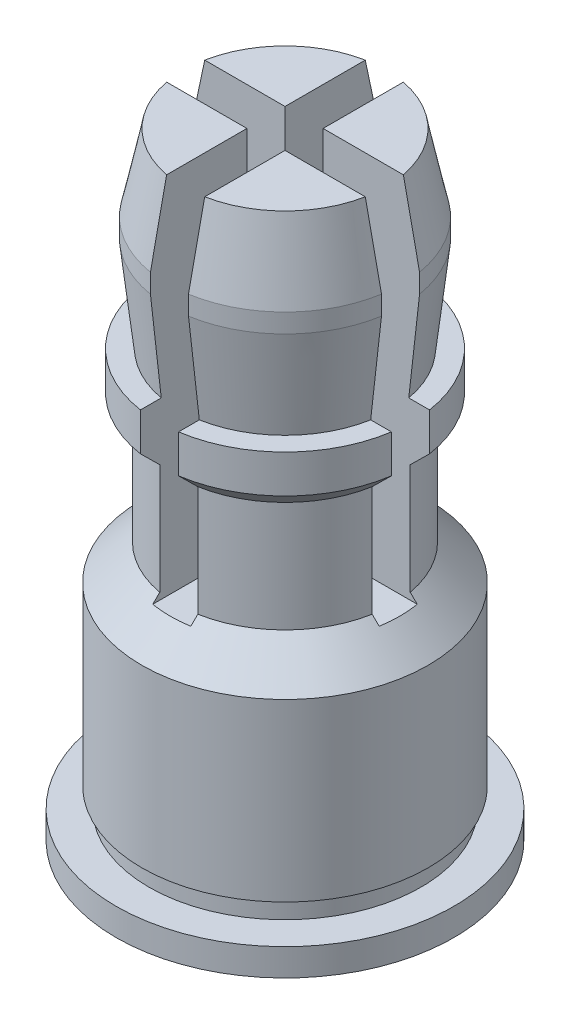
from build123d import *

# Parameters (mm, degrees)
SLITCUTSKE_W     = 5.33220965
SLITCUTSKE_H     = 0.7155
SLITCUT_DEPTH    = 6.8582
SLITCUTPAT_COUNT = 2
SLITCUTPAT_ANGLE = 90


with BuildPart() as part:
    # BodySke → Body (revolve)
    with BuildSketch(Plane.XY, mode=Mode.PRIVATE) as body_sk:
        Polygon((2.5555, 0.51), (2.5555, 0.8925), (2.69, 0.8925), (2.69, 4.18905), (2.02725, 4.8518), (2.02725, 6.92675), (2.385, 7.2845), (2.385, 8), (2, 8), (2.2, 9.79), (2.2, 10.148), (1.9, 11.58), (0, 11.58), (0, 0), (3.175, 0), (3.175, 0.51), align=None)
    revolve(body_sk.sketch.rotate(Axis((0, 0, 0), (0, 1, 0)), 90), axis=Axis((0, 0, 0), (0, 1, 0)))

    # SlitCutSke → SlitCut (cut)
    with BuildSketch(Plane(origin=(0, 11.58, 0), x_dir=(-1, 0, 0), z_dir=(0, 1, 0))):
        Rectangle(SLITCUTSKE_W, SLITCUTSKE_H)
    slitcut = extrude(amount=-SLITCUT_DEPTH, mode=Mode.SUBTRACT)

    # SlitCutPat: SlitCut ×2 about axis
    slitcutpat_axis = Axis((0, 0, 0), (0, 1, 0))
    for i in range(1, SLITCUTPAT_COUNT):
        add(slitcut.rotate(slitcutpat_axis, i * SLITCUTPAT_ANGLE / (SLITCUTPAT_COUNT - 1)), mode=Mode.SUBTRACT)


solid = part.part
